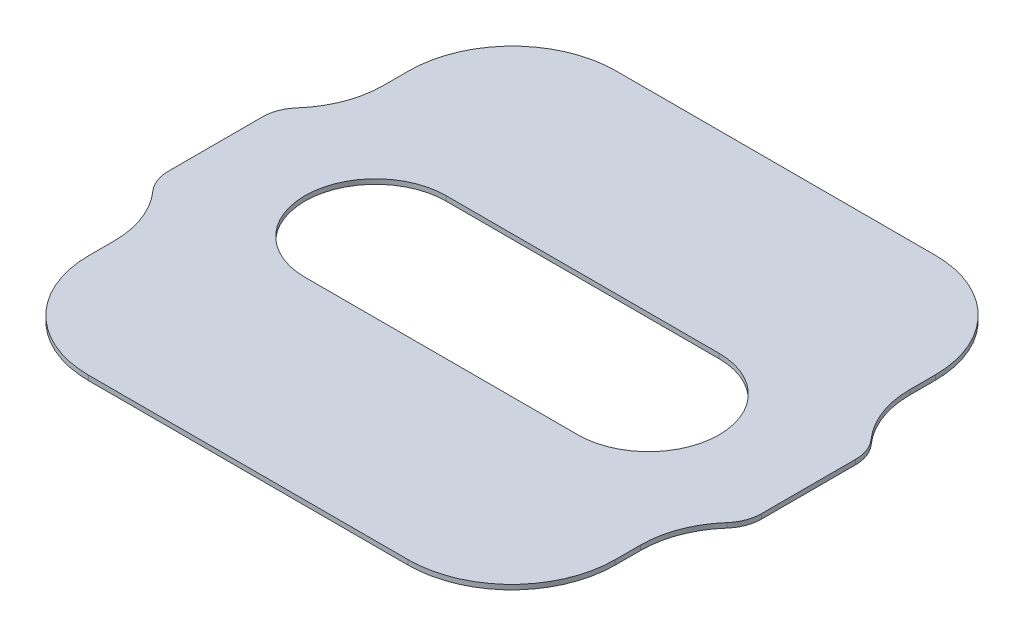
ISO-10303-21;
HEADER;
FILE_DESCRIPTION(('STEP AP214'),'2;1');
FILE_NAME('part.step','',(''),(''),'','','');
FILE_SCHEMA(('AUTOMOTIVE_DESIGN { 1 0 10303 214 1 1 1 1 }'));
ENDSEC;
DATA;
#1=APPLICATION_CONTEXT('core data for automotive mechanical design processes');
#2=APPLICATION_PROTOCOL_DEFINITION('international standard','automotive_design',2000,#1);
#3=PRODUCT_CONTEXT('',#1,'mechanical');
#4=PRODUCT('Part','Part','',(#3));
#5=PRODUCT_RELATED_PRODUCT_CATEGORY('part','',(#4));
#6=PRODUCT_DEFINITION_FORMATION('','',#4);
#7=PRODUCT_DEFINITION_CONTEXT('part definition',#1,'design');
#8=PRODUCT_DEFINITION('design','',#6,#7);
#9=PRODUCT_DEFINITION_SHAPE('','',#8);
#10=(LENGTH_UNIT() NAMED_UNIT(*) SI_UNIT(.MILLI.,.METRE.));
#11=(NAMED_UNIT(*) PLANE_ANGLE_UNIT() SI_UNIT($,.RADIAN.));
#12=(NAMED_UNIT(*) SI_UNIT($,.STERADIAN.) SOLID_ANGLE_UNIT());
#13=UNCERTAINTY_MEASURE_WITH_UNIT(LENGTH_MEASURE(1.E-05),#10,'distance_accuracy_value','');
#14=(GEOMETRIC_REPRESENTATION_CONTEXT(3) GLOBAL_UNCERTAINTY_ASSIGNED_CONTEXT((#13)) GLOBAL_UNIT_ASSIGNED_CONTEXT((#10,
#11,#12)) REPRESENTATION_CONTEXT('',''));
#15=CARTESIAN_POINT('',(0.,0.,0.));
#16=DIRECTION('',(0.,0.,1.));
#17=DIRECTION('',(1.,0.,0.));
#18=AXIS2_PLACEMENT_3D('',#15,#16,#17);
#19=CARTESIAN_POINT('',(16.1952754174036,0.0508,5.33075165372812));
#20=DIRECTION('',(0.,-1.,0.));
#21=DIRECTION('',(0.,0.,-1.));
#22=AXIS2_PLACEMENT_3D('',#19,#20,#21);
#23=CYLINDRICAL_SURFACE('',#22,0.400000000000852);
#24=CARTESIAN_POINT('',(16.1952754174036,0.,5.33075165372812));
#25=DIRECTION('',(0.,1.,0.));
#26=DIRECTION('',(0.,0.,1.));
#27=AXIS2_PLACEMENT_3D('',#24,#25,#26);
#28=CIRCLE('',#27,0.400000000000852);
#29=CARTESIAN_POINT('',(15.8963417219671,0.,5.06497233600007));
#30=VERTEX_POINT('',#29);
#31=CARTESIAN_POINT('',(15.7952754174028,0.,5.33075165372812));
#32=VERTEX_POINT('',#31);
#33=EDGE_CURVE('E230',#30,#32,#28,.T.);
#34=ORIENTED_EDGE('',*,*,#33,.T.);
#35=DIRECTION('',(0.,-1.,0.));
#36=VECTOR('',#35,1.);
#37=CARTESIAN_POINT('',(15.7952754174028,0.0508,5.33075165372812));
#38=LINE('',#37,#36);
#39=CARTESIAN_POINT('',(15.7952754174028,0.0508,5.33075165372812));
#40=VERTEX_POINT('',#39);
#41=EDGE_CURVE('E11',#40,#32,#38,.T.);
#42=ORIENTED_EDGE('',*,*,#41,.F.);
#43=CARTESIAN_POINT('',(16.1952754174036,0.0508,5.33075165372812));
#44=DIRECTION('',(0.,1.,0.));
#45=DIRECTION('',(0.,0.,1.));
#46=AXIS2_PLACEMENT_3D('',#43,#44,#45);
#47=CIRCLE('',#46,0.400000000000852);
#48=CARTESIAN_POINT('',(15.8963417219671,0.0508,5.06497233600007));
#49=VERTEX_POINT('',#48);
#50=EDGE_CURVE('E234',#49,#40,#47,.T.);
#51=ORIENTED_EDGE('',*,*,#50,.F.);
#52=DIRECTION('',(0.,-1.,0.));
#53=VECTOR('',#52,1.);
#54=CARTESIAN_POINT('',(15.8963417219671,0.0508,5.06497233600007));
#55=LINE('',#54,#53);
#56=EDGE_CURVE('E276',#49,#30,#55,.T.);
#57=ORIENTED_EDGE('',*,*,#56,.T.);
#58=EDGE_LOOP('',(#34,#42,#51,#57));
#59=FACE_BOUND('',#58,.T.);
#60=ADVANCED_FACE('F37',(#59),#23,.T.);
#61=CARTESIAN_POINT('',(15.7952754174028,0.0508,5.33075165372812));
#62=DIRECTION('',(1.,0.,0.));
#63=DIRECTION('',(0.,0.,-1.));
#64=AXIS2_PLACEMENT_3D('',#61,#62,#63);
#65=PLANE('',#64);
#66=DIRECTION('',(0.,0.,1.));
#67=VECTOR('',#66,1.);
#68=CARTESIAN_POINT('',(15.7952754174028,0.,5.33075165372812));
#69=LINE('',#68,#67);
#70=CARTESIAN_POINT('',(15.7952754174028,0.,6.33075165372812));
#71=VERTEX_POINT('',#70);
#72=EDGE_CURVE('E279',#32,#71,#69,.T.);
#73=ORIENTED_EDGE('',*,*,#72,.T.);
#74=DIRECTION('',(0.,-1.,0.));
#75=VECTOR('',#74,1.);
#76=CARTESIAN_POINT('',(15.7952754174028,0.0508,6.33075165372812));
#77=LINE('',#76,#75);
#78=CARTESIAN_POINT('',(15.7952754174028,0.0508,6.33075165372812));
#79=VERTEX_POINT('',#78);
#80=EDGE_CURVE('E44',#79,#71,#77,.T.);
#81=ORIENTED_EDGE('',*,*,#80,.F.);
#82=DIRECTION('',(0.,0.,1.));
#83=VECTOR('',#82,1.);
#84=CARTESIAN_POINT('',(15.7952754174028,0.0508,5.33075165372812));
#85=LINE('',#84,#83);
#86=EDGE_CURVE('E237',#40,#79,#85,.T.);
#87=ORIENTED_EDGE('',*,*,#86,.F.);
#88=ORIENTED_EDGE('',*,*,#41,.T.);
#89=EDGE_LOOP('',(#73,#81,#87,#88));
#90=FACE_BOUND('',#89,.T.);
#91=ADVANCED_FACE('F394',(#90),#65,.F.);
#92=CARTESIAN_POINT('',(16.1952754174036,0.0508,6.33075165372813));
#93=DIRECTION('',(0.,-1.,0.));
#94=DIRECTION('',(0.,0.,-1.));
#95=AXIS2_PLACEMENT_3D('',#92,#93,#94);
#96=CYLINDRICAL_SURFACE('',#95,0.400000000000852);
#97=CARTESIAN_POINT('',(16.1952754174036,0.,6.33075165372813));
#98=DIRECTION('',(0.,1.,0.));
#99=DIRECTION('',(0.,0.,-1.));
#100=AXIS2_PLACEMENT_3D('',#97,#98,#99);
#101=CIRCLE('',#100,0.400000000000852);
#102=CARTESIAN_POINT('',(15.8963417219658,0.,6.59653097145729));
#103=VERTEX_POINT('',#102);
#104=EDGE_CURVE('E281',#71,#103,#101,.T.);
#105=ORIENTED_EDGE('',*,*,#104,.T.);
#106=DIRECTION('',(0.,-1.,0.));
#107=VECTOR('',#106,1.);
#108=CARTESIAN_POINT('',(15.8963417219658,0.0508,6.59653097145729));
#109=LINE('',#108,#107);
#110=CARTESIAN_POINT('',(15.8963417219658,0.0508,6.59653097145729));
#111=VERTEX_POINT('',#110);
#112=EDGE_CURVE('E366',#111,#103,#109,.T.);
#113=ORIENTED_EDGE('',*,*,#112,.F.);
#114=CARTESIAN_POINT('',(16.1952754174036,0.0508,6.33075165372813));
#115=DIRECTION('',(0.,1.,0.));
#116=DIRECTION('',(0.,0.,-1.));
#117=AXIS2_PLACEMENT_3D('',#114,#115,#116);
#118=CIRCLE('',#117,0.400000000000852);
#119=EDGE_CURVE('E240',#79,#111,#118,.T.);
#120=ORIENTED_EDGE('',*,*,#119,.F.);
#121=ORIENTED_EDGE('',*,*,#80,.T.);
#122=EDGE_LOOP('',(#105,#113,#120,#121));
#123=FACE_BOUND('',#122,.T.);
#124=ADVANCED_FACE('F373',(#123),#96,.T.);
#125=CARTESIAN_POINT('',(15.149007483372,0.0508,7.2609792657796));
#126=DIRECTION('',(0.,-1.,0.));
#127=DIRECTION('',(0.,0.,-1.));
#128=AXIS2_PLACEMENT_3D('',#125,#126,#127);
#129=CYLINDRICAL_SURFACE('',#128,1.00000000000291);
#130=CARTESIAN_POINT('',(15.149007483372,0.,7.2609792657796));
#131=DIRECTION('',(0.,-1.,0.));
#132=DIRECTION('',(0.,0.,1.));
#133=AXIS2_PLACEMENT_3D('',#130,#131,#132);
#134=CIRCLE('',#133,1.00000000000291);
#135=CARTESIAN_POINT('',(16.1490074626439,0.,7.26077564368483));
#136=VERTEX_POINT('',#135);
#137=EDGE_CURVE('E283',#103,#136,#134,.T.);
#138=ORIENTED_EDGE('',*,*,#137,.T.);
#139=DIRECTION('',(0.,-1.,0.));
#140=VECTOR('',#139,1.);
#141=CARTESIAN_POINT('',(16.1490074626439,0.0508,7.26077564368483));
#142=LINE('',#141,#140);
#143=CARTESIAN_POINT('',(16.1490074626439,0.0508,7.26077564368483));
#144=VERTEX_POINT('',#143);
#145=EDGE_CURVE('E363',#144,#136,#142,.T.);
#146=ORIENTED_EDGE('',*,*,#145,.F.);
#147=CARTESIAN_POINT('',(15.149007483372,0.0508,7.2609792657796));
#148=DIRECTION('',(0.,-1.,0.));
#149=DIRECTION('',(0.,0.,1.));
#150=AXIS2_PLACEMENT_3D('',#147,#148,#149);
#151=CIRCLE('',#150,1.00000000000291);
#152=EDGE_CURVE('E242',#111,#144,#151,.T.);
#153=ORIENTED_EDGE('',*,*,#152,.F.);
#154=ORIENTED_EDGE('',*,*,#112,.T.);
#155=EDGE_LOOP('',(#138,#146,#153,#154));
#156=FACE_BOUND('',#155,.T.);
#157=ADVANCED_FACE('F382',(#156),#129,.F.);
#158=CARTESIAN_POINT('',(16.1490624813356,0.0508,7.53097563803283));
#159=DIRECTION('',(0.999999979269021,0.,-0.00020362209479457));
#160=DIRECTION('',(-0.00020362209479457,0.,-0.999999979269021));
#161=AXIS2_PLACEMENT_3D('',#158,#159,#160);
#162=PLANE('',#161);
#163=DIRECTION('',(0.00020362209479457,0.,0.999999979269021));
#164=VECTOR('',#163,1.);
#165=CARTESIAN_POINT('',(16.1490624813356,0.,7.53097563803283));
#166=LINE('',#165,#164);
#167=CARTESIAN_POINT('',(16.1490624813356,0.,7.53097563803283));
#168=VERTEX_POINT('',#167);
#169=EDGE_CURVE('E285',#136,#168,#166,.T.);
#170=ORIENTED_EDGE('',*,*,#169,.T.);
#171=DIRECTION('',(0.,-1.,0.));
#172=VECTOR('',#171,1.);
#173=CARTESIAN_POINT('',(16.1490624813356,0.0508,7.53097563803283));
#174=LINE('',#173,#172);
#175=CARTESIAN_POINT('',(16.1490624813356,0.0508,7.53097563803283));
#176=VERTEX_POINT('',#175);
#177=EDGE_CURVE('E360',#176,#168,#174,.T.);
#178=ORIENTED_EDGE('',*,*,#177,.F.);
#179=DIRECTION('',(0.00020362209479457,0.,0.999999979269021));
#180=VECTOR('',#179,1.);
#181=CARTESIAN_POINT('',(16.1490624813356,0.0508,7.53097563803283));
#182=LINE('',#181,#180);
#183=EDGE_CURVE('E244',#144,#176,#182,.T.);
#184=ORIENTED_EDGE('',*,*,#183,.F.);
#185=ORIENTED_EDGE('',*,*,#145,.T.);
#186=EDGE_LOOP('',(#170,#178,#184,#185));
#187=FACE_BOUND('',#186,.T.);
#188=ADVANCED_FACE('F386',(#187),#162,.F.);
#189=CARTESIAN_POINT('',(17.2490624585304,0.0508,7.53075165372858));
#190=DIRECTION('',(0.,-1.,0.));
#191=DIRECTION('',(0.,0.,-1.));
#192=AXIS2_PLACEMENT_3D('',#189,#190,#191);
#193=CYLINDRICAL_SURFACE('',#192,1.10000000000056);
#194=CARTESIAN_POINT('',(17.2490624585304,0.,7.53075165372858));
#195=DIRECTION('',(0.,1.,0.));
#196=DIRECTION('',(0.,0.,-1.));
#197=AXIS2_PLACEMENT_3D('',#194,#195,#196);
#198=CIRCLE('',#197,1.10000000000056);
#199=CARTESIAN_POINT('',(17.2490624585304,0.,8.63075165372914));
#200=VERTEX_POINT('',#199);
#201=EDGE_CURVE('E287',#168,#200,#198,.T.);
#202=ORIENTED_EDGE('',*,*,#201,.T.);
#203=DIRECTION('',(0.,-1.,0.));
#204=VECTOR('',#203,1.);
#205=CARTESIAN_POINT('',(17.2490624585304,0.0508,8.63075165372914));
#206=LINE('',#205,#204);
#207=CARTESIAN_POINT('',(17.2490624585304,0.0508,8.63075165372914));
#208=VERTEX_POINT('',#207);
#209=EDGE_CURVE('E357',#208,#200,#206,.T.);
#210=ORIENTED_EDGE('',*,*,#209,.F.);
#211=CARTESIAN_POINT('',(17.2490624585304,0.0508,7.53075165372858));
#212=DIRECTION('',(0.,1.,0.));
#213=DIRECTION('',(0.,0.,-1.));
#214=AXIS2_PLACEMENT_3D('',#211,#212,#213);
#215=CIRCLE('',#214,1.10000000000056);
#216=EDGE_CURVE('E246',#176,#208,#215,.T.);
#217=ORIENTED_EDGE('',*,*,#216,.F.);
#218=ORIENTED_EDGE('',*,*,#177,.T.);
#219=EDGE_LOOP('',(#202,#210,#217,#218));
#220=FACE_BOUND('',#219,.T.);
#221=ADVANCED_FACE('F467',(#220),#193,.T.);
#222=CARTESIAN_POINT('',(20.6414883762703,0.0508,8.63075165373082));
#223=DIRECTION('',(0.,0.,-1.));
#224=DIRECTION('',(-1.,0.,0.));
#225=AXIS2_PLACEMENT_3D('',#222,#223,#224);
#226=PLANE('',#225);
#227=DIRECTION('',(1.,0.,0.));
#228=VECTOR('',#227,1.);
#229=CARTESIAN_POINT('',(20.6414883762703,0.,8.63075165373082));
#230=LINE('',#229,#228);
#231=CARTESIAN_POINT('',(20.6414883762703,0.,8.63075165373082));
#232=VERTEX_POINT('',#231);
#233=EDGE_CURVE('E289',#200,#232,#230,.T.);
#234=ORIENTED_EDGE('',*,*,#233,.T.);
#235=DIRECTION('',(0.,-1.,0.));
#236=VECTOR('',#235,1.);
#237=CARTESIAN_POINT('',(20.6414883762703,0.0508,8.63075165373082));
#238=LINE('',#237,#236);
#239=CARTESIAN_POINT('',(20.6414883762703,0.0508,8.63075165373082));
#240=VERTEX_POINT('',#239);
#241=EDGE_CURVE('E354',#240,#232,#238,.T.);
#242=ORIENTED_EDGE('',*,*,#241,.F.);
#243=DIRECTION('',(1.,0.,0.));
#244=VECTOR('',#243,1.);
#245=CARTESIAN_POINT('',(20.6414883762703,0.0508,8.63075165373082));
#246=LINE('',#245,#244);
#247=EDGE_CURVE('E248',#208,#240,#246,.T.);
#248=ORIENTED_EDGE('',*,*,#247,.F.);
#249=ORIENTED_EDGE('',*,*,#209,.T.);
#250=EDGE_LOOP('',(#234,#242,#248,#249));
#251=FACE_BOUND('',#250,.T.);
#252=ADVANCED_FACE('F465',(#251),#226,.F.);
#253=CARTESIAN_POINT('',(20.6414883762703,0.0508,7.53075165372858));
#254=DIRECTION('',(0.,-1.,0.));
#255=DIRECTION('',(0.,0.,-1.));
#256=AXIS2_PLACEMENT_3D('',#253,#254,#255);
#257=CYLINDRICAL_SURFACE('',#256,1.10000000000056);
#258=CARTESIAN_POINT('',(20.6414883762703,0.,7.53075165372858));
#259=DIRECTION('',(0.,1.,0.));
#260=DIRECTION('',(0.,0.,1.));
#261=AXIS2_PLACEMENT_3D('',#258,#259,#260);
#262=CIRCLE('',#261,1.10000000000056);
#263=CARTESIAN_POINT('',(21.7414883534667,0.,7.53097563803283));
#264=VERTEX_POINT('',#263);
#265=EDGE_CURVE('E291',#232,#264,#262,.T.);
#266=ORIENTED_EDGE('',*,*,#265,.T.);
#267=DIRECTION('',(0.,-1.,0.));
#268=VECTOR('',#267,1.);
#269=CARTESIAN_POINT('',(21.7414883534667,0.0508,7.53097563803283));
#270=LINE('',#269,#268);
#271=CARTESIAN_POINT('',(21.7414883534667,0.0508,7.53097563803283));
#272=VERTEX_POINT('',#271);
#273=EDGE_CURVE('E351',#272,#264,#270,.T.);
#274=ORIENTED_EDGE('',*,*,#273,.F.);
#275=CARTESIAN_POINT('',(20.6414883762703,0.0508,7.53075165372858));
#276=DIRECTION('',(0.,1.,0.));
#277=DIRECTION('',(0.,0.,1.));
#278=AXIS2_PLACEMENT_3D('',#275,#276,#277);
#279=CIRCLE('',#278,1.10000000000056);
#280=EDGE_CURVE('E250',#240,#272,#279,.T.);
#281=ORIENTED_EDGE('',*,*,#280,.F.);
#282=ORIENTED_EDGE('',*,*,#241,.T.);
#283=EDGE_LOOP('',(#266,#274,#281,#282));
#284=FACE_BOUND('',#283,.T.);
#285=ADVANCED_FACE('F460',(#284),#257,.T.);
#286=CARTESIAN_POINT('',(21.7414883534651,0.0508,7.53097563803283));
#287=DIRECTION('',(-0.999999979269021,0.,-0.00020362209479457));
#288=DIRECTION('',(-0.00020362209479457,0.,0.999999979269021));
#289=AXIS2_PLACEMENT_3D('',#286,#287,#288);
#290=PLANE('',#289);
#291=DIRECTION('',(0.00020362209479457,0.,-0.999999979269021));
#292=VECTOR('',#291,1.);
#293=CARTESIAN_POINT('',(21.7414883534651,0.,7.53097563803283));
#294=LINE('',#293,#292);
#295=CARTESIAN_POINT('',(21.7415433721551,0.,7.26077564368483));
#296=VERTEX_POINT('',#295);
#297=EDGE_CURVE('E293',#264,#296,#294,.T.);
#298=ORIENTED_EDGE('',*,*,#297,.T.);
#299=DIRECTION('',(0.,-1.,0.));
#300=VECTOR('',#299,1.);
#301=CARTESIAN_POINT('',(21.7415433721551,0.0508,7.26077564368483));
#302=LINE('',#301,#300);
#303=CARTESIAN_POINT('',(21.7415433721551,0.0508,7.26077564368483));
#304=VERTEX_POINT('',#303);
#305=EDGE_CURVE('E348',#304,#296,#302,.T.);
#306=ORIENTED_EDGE('',*,*,#305,.F.);
#307=DIRECTION('',(0.00020362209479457,0.,-0.999999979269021));
#308=VECTOR('',#307,1.);
#309=CARTESIAN_POINT('',(21.7414883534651,0.0508,7.53097563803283));
#310=LINE('',#309,#308);
#311=EDGE_CURVE('E252',#272,#304,#310,.T.);
#312=ORIENTED_EDGE('',*,*,#311,.F.);
#313=ORIENTED_EDGE('',*,*,#273,.T.);
#314=EDGE_LOOP('',(#298,#306,#312,#313));
#315=FACE_BOUND('',#314,.T.);
#316=ADVANCED_FACE('F455',(#315),#290,.F.);
#317=CARTESIAN_POINT('',(22.7415433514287,0.0508,7.2609792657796));
#318=DIRECTION('',(0.,-1.,0.));
#319=DIRECTION('',(0.,0.,-1.));
#320=AXIS2_PLACEMENT_3D('',#317,#318,#319);
#321=CYLINDRICAL_SURFACE('',#320,1.00000000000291);
#322=CARTESIAN_POINT('',(22.7415433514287,0.,7.2609792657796));
#323=DIRECTION('',(0.,-1.,0.));
#324=DIRECTION('',(0.,0.,-1.));
#325=AXIS2_PLACEMENT_3D('',#322,#323,#324);
#326=CIRCLE('',#325,1.00000000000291);
#327=CARTESIAN_POINT('',(21.9942091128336,0.,6.59653097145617));
#328=VERTEX_POINT('',#327);
#329=EDGE_CURVE('E295',#296,#328,#326,.T.);
#330=ORIENTED_EDGE('',*,*,#329,.T.);
#331=DIRECTION('',(0.,-1.,0.));
#332=VECTOR('',#331,1.);
#333=CARTESIAN_POINT('',(21.9942091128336,0.0508,6.59653097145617));
#334=LINE('',#333,#332);
#335=CARTESIAN_POINT('',(21.9942091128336,0.0508,6.59653097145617));
#336=VERTEX_POINT('',#335);
#337=EDGE_CURVE('E345',#336,#328,#334,.T.);
#338=ORIENTED_EDGE('',*,*,#337,.F.);
#339=CARTESIAN_POINT('',(22.7415433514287,0.0508,7.2609792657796));
#340=DIRECTION('',(0.,-1.,0.));
#341=DIRECTION('',(0.,0.,-1.));
#342=AXIS2_PLACEMENT_3D('',#339,#340,#341);
#343=CIRCLE('',#342,1.00000000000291);
#344=EDGE_CURVE('E254',#304,#336,#343,.T.);
#345=ORIENTED_EDGE('',*,*,#344,.F.);
#346=ORIENTED_EDGE('',*,*,#305,.T.);
#347=EDGE_LOOP('',(#330,#338,#345,#346));
#348=FACE_BOUND('',#347,.T.);
#349=ADVANCED_FACE('F451',(#348),#321,.F.);
#350=CARTESIAN_POINT('',(21.695275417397,0.0508,6.33075165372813));
#351=DIRECTION('',(0.,-1.,0.));
#352=DIRECTION('',(0.,0.,-1.));
#353=AXIS2_PLACEMENT_3D('',#350,#351,#352);
#354=CYLINDRICAL_SURFACE('',#353,0.400000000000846);
#355=CARTESIAN_POINT('',(21.695275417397,0.,6.33075165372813));
#356=DIRECTION('',(0.,1.,0.));
#357=DIRECTION('',(0.,0.,1.));
#358=AXIS2_PLACEMENT_3D('',#355,#356,#357);
#359=CIRCLE('',#358,0.400000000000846);
#360=CARTESIAN_POINT('',(22.0952754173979,0.,6.33075165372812));
#361=VERTEX_POINT('',#360);
#362=EDGE_CURVE('E297',#328,#361,#359,.T.);
#363=ORIENTED_EDGE('',*,*,#362,.T.);
#364=DIRECTION('',(0.,-1.,0.));
#365=VECTOR('',#364,1.);
#366=CARTESIAN_POINT('',(22.0952754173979,0.0508,6.33075165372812));
#367=LINE('',#366,#365);
#368=CARTESIAN_POINT('',(22.0952754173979,0.0508,6.33075165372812));
#369=VERTEX_POINT('',#368);
#370=EDGE_CURVE('E342',#369,#361,#367,.T.);
#371=ORIENTED_EDGE('',*,*,#370,.F.);
#372=CARTESIAN_POINT('',(21.695275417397,0.0508,6.33075165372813));
#373=DIRECTION('',(0.,1.,0.));
#374=DIRECTION('',(0.,0.,1.));
#375=AXIS2_PLACEMENT_3D('',#372,#373,#374);
#376=CIRCLE('',#375,0.400000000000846);
#377=EDGE_CURVE('E256',#336,#369,#376,.T.);
#378=ORIENTED_EDGE('',*,*,#377,.F.);
#379=ORIENTED_EDGE('',*,*,#337,.T.);
#380=EDGE_LOOP('',(#363,#371,#378,#379));
#381=FACE_BOUND('',#380,.T.);
#382=ADVANCED_FACE('F446',(#381),#354,.T.);
#383=CARTESIAN_POINT('',(22.0952754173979,0.0508,5.33075165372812));
#384=DIRECTION('',(-1.,0.,0.));
#385=DIRECTION('',(0.,0.,1.));
#386=AXIS2_PLACEMENT_3D('',#383,#384,#385);
#387=PLANE('',#386);
#388=DIRECTION('',(0.,0.,-1.));
#389=VECTOR('',#388,1.);
#390=CARTESIAN_POINT('',(22.0952754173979,0.,5.33075165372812));
#391=LINE('',#390,#389);
#392=CARTESIAN_POINT('',(22.0952754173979,0.,5.33075165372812));
#393=VERTEX_POINT('',#392);
#394=EDGE_CURVE('E299',#361,#393,#391,.T.);
#395=ORIENTED_EDGE('',*,*,#394,.T.);
#396=DIRECTION('',(0.,-1.,0.));
#397=VECTOR('',#396,1.);
#398=CARTESIAN_POINT('',(22.0952754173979,0.0508,5.33075165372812));
#399=LINE('',#398,#397);
#400=CARTESIAN_POINT('',(22.0952754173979,0.0508,5.33075165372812));
#401=VERTEX_POINT('',#400);
#402=EDGE_CURVE('E339',#401,#393,#399,.T.);
#403=ORIENTED_EDGE('',*,*,#402,.F.);
#404=DIRECTION('',(0.,0.,-1.));
#405=VECTOR('',#404,1.);
#406=CARTESIAN_POINT('',(22.0952754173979,0.0508,5.33075165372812));
#407=LINE('',#406,#405);
#408=EDGE_CURVE('E258',#369,#401,#407,.T.);
#409=ORIENTED_EDGE('',*,*,#408,.F.);
#410=ORIENTED_EDGE('',*,*,#370,.T.);
#411=EDGE_LOOP('',(#395,#403,#409,#410));
#412=FACE_BOUND('',#411,.T.);
#413=ADVANCED_FACE('F440',(#412),#387,.F.);
#414=CARTESIAN_POINT('',(21.695275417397,0.0508,5.33075165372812));
#415=DIRECTION('',(0.,-1.,0.));
#416=DIRECTION('',(0.,0.,-1.));
#417=AXIS2_PLACEMENT_3D('',#414,#415,#416);
#418=CYLINDRICAL_SURFACE('',#417,0.400000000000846);
#419=CARTESIAN_POINT('',(21.695275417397,0.,5.33075165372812));
#420=DIRECTION('',(0.,1.,0.));
#421=DIRECTION('',(0.,0.,-1.));
#422=AXIS2_PLACEMENT_3D('',#419,#420,#421);
#423=CIRCLE('',#422,0.400000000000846);
#424=CARTESIAN_POINT('',(21.9942091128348,0.,5.06497233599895));
#425=VERTEX_POINT('',#424);
#426=EDGE_CURVE('E301',#393,#425,#423,.T.);
#427=ORIENTED_EDGE('',*,*,#426,.T.);
#428=DIRECTION('',(0.,-1.,0.));
#429=VECTOR('',#428,1.);
#430=CARTESIAN_POINT('',(21.9942091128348,0.0508,5.06497233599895));
#431=LINE('',#430,#429);
#432=CARTESIAN_POINT('',(21.9942091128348,0.0508,5.06497233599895));
#433=VERTEX_POINT('',#432);
#434=EDGE_CURVE('E336',#433,#425,#431,.T.);
#435=ORIENTED_EDGE('',*,*,#434,.F.);
#436=CARTESIAN_POINT('',(21.695275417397,0.0508,5.33075165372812));
#437=DIRECTION('',(0.,1.,0.));
#438=DIRECTION('',(0.,0.,-1.));
#439=AXIS2_PLACEMENT_3D('',#436,#437,#438);
#440=CIRCLE('',#439,0.400000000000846);
#441=EDGE_CURVE('E260',#401,#433,#440,.T.);
#442=ORIENTED_EDGE('',*,*,#441,.F.);
#443=ORIENTED_EDGE('',*,*,#402,.T.);
#444=EDGE_LOOP('',(#427,#435,#442,#443));
#445=FACE_BOUND('',#444,.T.);
#446=ADVANCED_FACE('F436',(#445),#418,.T.);
#447=CARTESIAN_POINT('',(22.7415433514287,0.0508,4.40052404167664));
#448=DIRECTION('',(0.,-1.,0.));
#449=DIRECTION('',(0.,0.,-1.));
#450=AXIS2_PLACEMENT_3D('',#447,#448,#449);
#451=CYLINDRICAL_SURFACE('',#450,1.00000000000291);
#452=CARTESIAN_POINT('',(22.7415433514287,0.,4.40052404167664));
#453=DIRECTION('',(0.,-1.,0.));
#454=DIRECTION('',(0.,0.,1.));
#455=AXIS2_PLACEMENT_3D('',#452,#453,#454);
#456=CIRCLE('',#455,1.00000000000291);
#457=CARTESIAN_POINT('',(21.7415433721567,0.,4.40072766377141));
#458=VERTEX_POINT('',#457);
#459=EDGE_CURVE('E303',#425,#458,#456,.T.);
#460=ORIENTED_EDGE('',*,*,#459,.T.);
#461=DIRECTION('',(0.,-1.,0.));
#462=VECTOR('',#461,1.);
#463=CARTESIAN_POINT('',(21.7415433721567,0.0508,4.40072766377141));
#464=LINE('',#463,#462);
#465=CARTESIAN_POINT('',(21.7415433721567,0.0508,4.40072766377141));
#466=VERTEX_POINT('',#465);
#467=EDGE_CURVE('E333',#466,#458,#464,.T.);
#468=ORIENTED_EDGE('',*,*,#467,.F.);
#469=CARTESIAN_POINT('',(22.7415433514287,0.0508,4.40052404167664));
#470=DIRECTION('',(0.,-1.,0.));
#471=DIRECTION('',(0.,0.,1.));
#472=AXIS2_PLACEMENT_3D('',#469,#470,#471);
#473=CIRCLE('',#472,1.00000000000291);
#474=EDGE_CURVE('E262',#433,#466,#473,.T.);
#475=ORIENTED_EDGE('',*,*,#474,.F.);
#476=ORIENTED_EDGE('',*,*,#434,.T.);
#477=EDGE_LOOP('',(#460,#468,#475,#476));
#478=FACE_BOUND('',#477,.T.);
#479=ADVANCED_FACE('F431',(#478),#451,.F.);
#480=CARTESIAN_POINT('',(21.7414883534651,0.0508,4.13052766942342));
#481=DIRECTION('',(-0.999999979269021,0.,0.00020362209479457));
#482=DIRECTION('',(0.00020362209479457,0.,0.999999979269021));
#483=AXIS2_PLACEMENT_3D('',#480,#481,#482);
#484=PLANE('',#483);
#485=DIRECTION('',(-0.00020362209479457,0.,-0.999999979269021));
#486=VECTOR('',#485,1.);
#487=CARTESIAN_POINT('',(21.7414883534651,0.,4.13052766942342));
#488=LINE('',#487,#486);
#489=CARTESIAN_POINT('',(21.7414883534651,0.,4.13052766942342));
#490=VERTEX_POINT('',#489);
#491=EDGE_CURVE('E305',#458,#490,#488,.T.);
#492=ORIENTED_EDGE('',*,*,#491,.T.);
#493=DIRECTION('',(0.,-1.,0.));
#494=VECTOR('',#493,1.);
#495=CARTESIAN_POINT('',(21.7414883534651,0.0508,4.13052766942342));
#496=LINE('',#495,#494);
#497=CARTESIAN_POINT('',(21.7414883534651,0.0508,4.13052766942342));
#498=VERTEX_POINT('',#497);
#499=EDGE_CURVE('E330',#498,#490,#496,.T.);
#500=ORIENTED_EDGE('',*,*,#499,.F.);
#501=DIRECTION('',(-0.00020362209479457,0.,-0.999999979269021));
#502=VECTOR('',#501,1.);
#503=CARTESIAN_POINT('',(21.7414883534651,0.0508,4.13052766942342));
#504=LINE('',#503,#502);
#505=EDGE_CURVE('E264',#466,#498,#504,.T.);
#506=ORIENTED_EDGE('',*,*,#505,.F.);
#507=ORIENTED_EDGE('',*,*,#467,.T.);
#508=EDGE_LOOP('',(#492,#500,#506,#507));
#509=FACE_BOUND('',#508,.T.);
#510=ADVANCED_FACE('F425',(#509),#484,.F.);
#511=CARTESIAN_POINT('',(20.6414883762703,0.0508,4.13075165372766));
#512=DIRECTION('',(0.,-1.,0.));
#513=DIRECTION('',(0.,0.,-1.));
#514=AXIS2_PLACEMENT_3D('',#511,#512,#513);
#515=CYLINDRICAL_SURFACE('',#514,1.10000000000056);
#516=CARTESIAN_POINT('',(20.6414883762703,0.,4.13075165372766));
#517=DIRECTION('',(0.,1.,0.));
#518=DIRECTION('',(0.,0.,-1.));
#519=AXIS2_PLACEMENT_3D('',#516,#517,#518);
#520=CIRCLE('',#519,1.10000000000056);
#521=CARTESIAN_POINT('',(20.6414883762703,0.,3.0307516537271));
#522=VERTEX_POINT('',#521);
#523=EDGE_CURVE('E307',#490,#522,#520,.T.);
#524=ORIENTED_EDGE('',*,*,#523,.T.);
#525=DIRECTION('',(0.,-1.,0.));
#526=VECTOR('',#525,1.);
#527=CARTESIAN_POINT('',(20.6414883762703,0.0508,3.0307516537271));
#528=LINE('',#527,#526);
#529=CARTESIAN_POINT('',(20.6414883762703,0.0508,3.0307516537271));
#530=VERTEX_POINT('',#529);
#531=EDGE_CURVE('E327',#530,#522,#528,.T.);
#532=ORIENTED_EDGE('',*,*,#531,.F.);
#533=CARTESIAN_POINT('',(20.6414883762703,0.0508,4.13075165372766));
#534=DIRECTION('',(0.,1.,0.));
#535=DIRECTION('',(0.,0.,-1.));
#536=AXIS2_PLACEMENT_3D('',#533,#534,#535);
#537=CIRCLE('',#536,1.10000000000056);
#538=EDGE_CURVE('E266',#498,#530,#537,.T.);
#539=ORIENTED_EDGE('',*,*,#538,.F.);
#540=ORIENTED_EDGE('',*,*,#499,.T.);
#541=EDGE_LOOP('',(#524,#532,#539,#540));
#542=FACE_BOUND('',#541,.T.);
#543=ADVANCED_FACE('F421',(#542),#515,.T.);
#544=CARTESIAN_POINT('',(20.6414883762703,0.0508,3.03075165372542));
#545=DIRECTION('',(0.,0.,1.));
#546=DIRECTION('',(1.,0.,0.));
#547=AXIS2_PLACEMENT_3D('',#544,#545,#546);
#548=PLANE('',#547);
#549=DIRECTION('',(-1.,0.,0.));
#550=VECTOR('',#549,1.);
#551=CARTESIAN_POINT('',(20.6414883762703,0.,3.03075165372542));
#552=LINE('',#551,#550);
#553=CARTESIAN_POINT('',(17.2490624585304,0.,3.03075165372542));
#554=VERTEX_POINT('',#553);
#555=EDGE_CURVE('E309',#522,#554,#552,.T.);
#556=ORIENTED_EDGE('',*,*,#555,.T.);
#557=DIRECTION('',(0.,-1.,0.));
#558=VECTOR('',#557,1.);
#559=CARTESIAN_POINT('',(17.2490624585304,0.0508,3.03075165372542));
#560=LINE('',#559,#558);
#561=CARTESIAN_POINT('',(17.2490624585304,0.0508,3.03075165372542));
#562=VERTEX_POINT('',#561);
#563=EDGE_CURVE('E324',#562,#554,#560,.T.);
#564=ORIENTED_EDGE('',*,*,#563,.F.);
#565=DIRECTION('',(-1.,0.,0.));
#566=VECTOR('',#565,1.);
#567=CARTESIAN_POINT('',(20.6414883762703,0.0508,3.03075165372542));
#568=LINE('',#567,#566);
#569=EDGE_CURVE('E268',#530,#562,#568,.T.);
#570=ORIENTED_EDGE('',*,*,#569,.F.);
#571=ORIENTED_EDGE('',*,*,#531,.T.);
#572=EDGE_LOOP('',(#556,#564,#570,#571));
#573=FACE_BOUND('',#572,.T.);
#574=ADVANCED_FACE('F416',(#573),#548,.F.);
#575=CARTESIAN_POINT('',(17.2490624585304,0.0508,4.13075165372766));
#576=DIRECTION('',(0.,-1.,0.));
#577=DIRECTION('',(0.,0.,-1.));
#578=AXIS2_PLACEMENT_3D('',#575,#576,#577);
#579=CYLINDRICAL_SURFACE('',#578,1.10000000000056);
#580=CARTESIAN_POINT('',(17.2490624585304,0.,4.13075165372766));
#581=DIRECTION('',(0.,1.,0.));
#582=DIRECTION('',(0.,0.,1.));
#583=AXIS2_PLACEMENT_3D('',#580,#581,#582);
#584=CIRCLE('',#583,1.10000000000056);
#585=CARTESIAN_POINT('',(16.1490624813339,0.,4.13052766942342));
#586=VERTEX_POINT('',#585);
#587=EDGE_CURVE('E311',#554,#586,#584,.T.);
#588=ORIENTED_EDGE('',*,*,#587,.T.);
#589=DIRECTION('',(0.,-1.,0.));
#590=VECTOR('',#589,1.);
#591=CARTESIAN_POINT('',(16.1490624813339,0.0508,4.13052766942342));
#592=LINE('',#591,#590);
#593=CARTESIAN_POINT('',(16.1490624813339,0.0508,4.13052766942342));
#594=VERTEX_POINT('',#593);
#595=EDGE_CURVE('E321',#594,#586,#592,.T.);
#596=ORIENTED_EDGE('',*,*,#595,.F.);
#597=CARTESIAN_POINT('',(17.2490624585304,0.0508,4.13075165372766));
#598=DIRECTION('',(0.,1.,0.));
#599=DIRECTION('',(0.,0.,1.));
#600=AXIS2_PLACEMENT_3D('',#597,#598,#599);
#601=CIRCLE('',#600,1.10000000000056);
#602=EDGE_CURVE('E270',#562,#594,#601,.T.);
#603=ORIENTED_EDGE('',*,*,#602,.F.);
#604=ORIENTED_EDGE('',*,*,#563,.T.);
#605=EDGE_LOOP('',(#588,#596,#603,#604));
#606=FACE_BOUND('',#605,.T.);
#607=ADVANCED_FACE('F410',(#606),#579,.T.);
#608=CARTESIAN_POINT('',(16.1490624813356,0.0508,4.13052766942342));
#609=DIRECTION('',(0.999999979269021,0.,0.00020362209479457));
#610=DIRECTION('',(0.00020362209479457,0.,-0.999999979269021));
#611=AXIS2_PLACEMENT_3D('',#608,#609,#610);
#612=PLANE('',#611);
#613=DIRECTION('',(-0.00020362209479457,0.,0.999999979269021));
#614=VECTOR('',#613,1.);
#615=CARTESIAN_POINT('',(16.1490624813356,0.,4.13052766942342));
#616=LINE('',#615,#614);
#617=CARTESIAN_POINT('',(16.1490074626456,0.,4.40072766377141));
#618=VERTEX_POINT('',#617);
#619=EDGE_CURVE('E313',#586,#618,#616,.T.);
#620=ORIENTED_EDGE('',*,*,#619,.T.);
#621=DIRECTION('',(0.,-1.,0.));
#622=VECTOR('',#621,1.);
#623=CARTESIAN_POINT('',(16.1490074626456,0.0508,4.40072766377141));
#624=LINE('',#623,#622);
#625=CARTESIAN_POINT('',(16.1490074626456,0.0508,4.40072766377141));
#626=VERTEX_POINT('',#625);
#627=EDGE_CURVE('E318',#626,#618,#624,.T.);
#628=ORIENTED_EDGE('',*,*,#627,.F.);
#629=DIRECTION('',(-0.00020362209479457,0.,0.999999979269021));
#630=VECTOR('',#629,1.);
#631=CARTESIAN_POINT('',(16.1490624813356,0.0508,4.13052766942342));
#632=LINE('',#631,#630);
#633=EDGE_CURVE('E272',#594,#626,#632,.T.);
#634=ORIENTED_EDGE('',*,*,#633,.F.);
#635=ORIENTED_EDGE('',*,*,#595,.T.);
#636=EDGE_LOOP('',(#620,#628,#634,#635));
#637=FACE_BOUND('',#636,.T.);
#638=ADVANCED_FACE('F406',(#637),#612,.F.);
#639=CARTESIAN_POINT('',(15.149007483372,0.0508,4.40052404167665));
#640=DIRECTION('',(0.,-1.,0.));
#641=DIRECTION('',(0.,0.,-1.));
#642=AXIS2_PLACEMENT_3D('',#639,#640,#641);
#643=CYLINDRICAL_SURFACE('',#642,1.00000000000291);
#644=CARTESIAN_POINT('',(15.149007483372,0.,4.40052404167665));
#645=DIRECTION('',(0.,-1.,0.));
#646=DIRECTION('',(0.,0.,-1.));
#647=AXIS2_PLACEMENT_3D('',#644,#645,#646);
#648=CIRCLE('',#647,1.00000000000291);
#649=EDGE_CURVE('E238',#618,#30,#648,.T.);
#650=ORIENTED_EDGE('',*,*,#649,.T.);
#651=ORIENTED_EDGE('',*,*,#56,.F.);
#652=CARTESIAN_POINT('',(15.149007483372,0.0508,4.40052404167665));
#653=DIRECTION('',(0.,-1.,0.));
#654=DIRECTION('',(0.,0.,-1.));
#655=AXIS2_PLACEMENT_3D('',#652,#653,#654);
#656=CIRCLE('',#655,1.00000000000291);
#657=EDGE_CURVE('E274',#626,#49,#656,.T.);
#658=ORIENTED_EDGE('',*,*,#657,.F.);
#659=ORIENTED_EDGE('',*,*,#627,.T.);
#660=EDGE_LOOP('',(#650,#651,#658,#659));
#661=FACE_BOUND('',#660,.T.);
#662=ADVANCED_FACE('F401',(#661),#643,.F.);
#663=CARTESIAN_POINT('',(16.1952754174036,0.0508,5.33075165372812));
#664=DIRECTION('',(0.,1.,0.));
#665=DIRECTION('',(0.,0.,1.));
#666=AXIS2_PLACEMENT_3D('',#663,#664,#665);
#667=PLANE('',#666);
#668=CARTESIAN_POINT('',(17.4952754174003,0.0508,5.83075165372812));
#669=DIRECTION('',(0.,1.,0.));
#670=DIRECTION('',(0.,0.,1.));
#671=AXIS2_PLACEMENT_3D('',#668,#669,#670);
#672=CIRCLE('',#671,0.750000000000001);
#673=CARTESIAN_POINT('',(17.4952754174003,0.0508,5.08075165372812));
#674=VERTEX_POINT('',#673);
#675=CARTESIAN_POINT('',(17.4952754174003,0.0508,6.58075165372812));
#676=VERTEX_POINT('',#675);
#677=EDGE_CURVE('E51',#674,#676,#672,.T.);
#678=ORIENTED_EDGE('',*,*,#677,.F.);
#679=DIRECTION('',(-1.,0.,0.));
#680=VECTOR('',#679,1.);
#681=CARTESIAN_POINT('',(17.4952754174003,0.0508,5.08075165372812));
#682=LINE('',#681,#680);
#683=CARTESIAN_POINT('',(20.3952754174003,0.0508,5.08075165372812));
#684=VERTEX_POINT('',#683);
#685=EDGE_CURVE('E215',#684,#674,#682,.T.);
#686=ORIENTED_EDGE('',*,*,#685,.F.);
#687=CARTESIAN_POINT('',(20.3952754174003,0.0508,5.83075165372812));
#688=DIRECTION('',(0.,1.,0.));
#689=DIRECTION('',(0.,0.,1.));
#690=AXIS2_PLACEMENT_3D('',#687,#688,#689);
#691=CIRCLE('',#690,0.750000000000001);
#692=CARTESIAN_POINT('',(20.3952754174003,0.0508,6.58075165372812));
#693=VERTEX_POINT('',#692);
#694=EDGE_CURVE('E218',#693,#684,#691,.T.);
#695=ORIENTED_EDGE('',*,*,#694,.F.);
#696=DIRECTION('',(1.,0.,0.));
#697=VECTOR('',#696,1.);
#698=CARTESIAN_POINT('',(17.4952754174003,0.0508,6.58075165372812));
#699=LINE('',#698,#697);
#700=EDGE_CURVE('E224',#676,#693,#699,.T.);
#701=ORIENTED_EDGE('',*,*,#700,.F.);
#702=EDGE_LOOP('',(#678,#686,#695,#701));
#703=FACE_BOUND('',#702,.T.);
#704=ORIENTED_EDGE('',*,*,#50,.T.);
#705=ORIENTED_EDGE('',*,*,#86,.T.);
#706=ORIENTED_EDGE('',*,*,#119,.T.);
#707=ORIENTED_EDGE('',*,*,#152,.T.);
#708=ORIENTED_EDGE('',*,*,#183,.T.);
#709=ORIENTED_EDGE('',*,*,#216,.T.);
#710=ORIENTED_EDGE('',*,*,#247,.T.);
#711=ORIENTED_EDGE('',*,*,#280,.T.);
#712=ORIENTED_EDGE('',*,*,#311,.T.);
#713=ORIENTED_EDGE('',*,*,#344,.T.);
#714=ORIENTED_EDGE('',*,*,#377,.T.);
#715=ORIENTED_EDGE('',*,*,#408,.T.);
#716=ORIENTED_EDGE('',*,*,#441,.T.);
#717=ORIENTED_EDGE('',*,*,#474,.T.);
#718=ORIENTED_EDGE('',*,*,#505,.T.);
#719=ORIENTED_EDGE('',*,*,#538,.T.);
#720=ORIENTED_EDGE('',*,*,#569,.T.);
#721=ORIENTED_EDGE('',*,*,#602,.T.);
#722=ORIENTED_EDGE('',*,*,#633,.T.);
#723=ORIENTED_EDGE('',*,*,#657,.T.);
#724=EDGE_LOOP('',(#704,#705,#706,#707,#708,#709,#710,#711,#712,#713,#714,#715,#716,#717,#718,
#719,#720,#721,#722,#723));
#725=FACE_BOUND('',#724,.T.);
#726=ADVANCED_FACE('F390',(#703,#725),#667,.T.);
#727=CARTESIAN_POINT('',(16.1952754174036,0.,5.33075165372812));
#728=DIRECTION('',(0.,1.,0.));
#729=DIRECTION('',(0.,0.,1.));
#730=AXIS2_PLACEMENT_3D('',#727,#728,#729);
#731=PLANE('',#730);
#732=DIRECTION('',(-1.,0.,0.));
#733=VECTOR('',#732,1.);
#734=CARTESIAN_POINT('',(17.4952754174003,0.,5.08075165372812));
#735=LINE('',#734,#733);
#736=CARTESIAN_POINT('',(20.3952754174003,0.,5.08075165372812));
#737=VERTEX_POINT('',#736);
#738=CARTESIAN_POINT('',(17.4952754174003,0.,5.08075165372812));
#739=VERTEX_POINT('',#738);
#740=EDGE_CURVE('E205',#737,#739,#735,.T.);
#741=ORIENTED_EDGE('',*,*,#740,.T.);
#742=CARTESIAN_POINT('',(17.4952754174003,0.,5.83075165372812));
#743=DIRECTION('',(0.,1.,0.));
#744=DIRECTION('',(0.,0.,1.));
#745=AXIS2_PLACEMENT_3D('',#742,#743,#744);
#746=CIRCLE('',#745,0.750000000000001);
#747=CARTESIAN_POINT('',(17.4952754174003,0.,6.58075165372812));
#748=VERTEX_POINT('',#747);
#749=EDGE_CURVE('E199',#739,#748,#746,.T.);
#750=ORIENTED_EDGE('',*,*,#749,.T.);
#751=DIRECTION('',(1.,0.,0.));
#752=VECTOR('',#751,1.);
#753=CARTESIAN_POINT('',(17.4952754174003,0.,6.58075165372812));
#754=LINE('',#753,#752);
#755=CARTESIAN_POINT('',(20.3952754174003,0.,6.58075165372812));
#756=VERTEX_POINT('',#755);
#757=EDGE_CURVE('E208',#748,#756,#754,.T.);
#758=ORIENTED_EDGE('',*,*,#757,.T.);
#759=CARTESIAN_POINT('',(20.3952754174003,0.,5.83075165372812));
#760=DIRECTION('',(0.,1.,0.));
#761=DIRECTION('',(0.,0.,1.));
#762=AXIS2_PLACEMENT_3D('',#759,#760,#761);
#763=CIRCLE('',#762,0.750000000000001);
#764=EDGE_CURVE('E59',#756,#737,#763,.T.);
#765=ORIENTED_EDGE('',*,*,#764,.T.);
#766=EDGE_LOOP('',(#741,#750,#758,#765));
#767=FACE_BOUND('',#766,.T.);
#768=ORIENTED_EDGE('',*,*,#33,.F.);
#769=ORIENTED_EDGE('',*,*,#649,.F.);
#770=ORIENTED_EDGE('',*,*,#619,.F.);
#771=ORIENTED_EDGE('',*,*,#587,.F.);
#772=ORIENTED_EDGE('',*,*,#555,.F.);
#773=ORIENTED_EDGE('',*,*,#523,.F.);
#774=ORIENTED_EDGE('',*,*,#491,.F.);
#775=ORIENTED_EDGE('',*,*,#459,.F.);
#776=ORIENTED_EDGE('',*,*,#426,.F.);
#777=ORIENTED_EDGE('',*,*,#394,.F.);
#778=ORIENTED_EDGE('',*,*,#362,.F.);
#779=ORIENTED_EDGE('',*,*,#329,.F.);
#780=ORIENTED_EDGE('',*,*,#297,.F.);
#781=ORIENTED_EDGE('',*,*,#265,.F.);
#782=ORIENTED_EDGE('',*,*,#233,.F.);
#783=ORIENTED_EDGE('',*,*,#201,.F.);
#784=ORIENTED_EDGE('',*,*,#169,.F.);
#785=ORIENTED_EDGE('',*,*,#137,.F.);
#786=ORIENTED_EDGE('',*,*,#104,.F.);
#787=ORIENTED_EDGE('',*,*,#72,.F.);
#788=EDGE_LOOP('',(#768,#769,#770,#771,#772,#773,#774,#775,#776,#777,#778,#779,#780,#781,#782,
#783,#784,#785,#786,#787));
#789=FACE_BOUND('',#788,.T.);
#790=ADVANCED_FACE('F212',(#767,#789),#731,.F.);
#791=CARTESIAN_POINT('',(17.4952754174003,0.,5.83075165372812));
#792=DIRECTION('',(0.,1.,0.));
#793=DIRECTION('',(0.,0.,1.));
#794=AXIS2_PLACEMENT_3D('',#791,#792,#793);
#795=CYLINDRICAL_SURFACE('',#794,0.750000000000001);
#796=ORIENTED_EDGE('',*,*,#677,.T.);
#797=DIRECTION('',(0.,1.,0.));
#798=VECTOR('',#797,1.);
#799=CARTESIAN_POINT('',(17.4952754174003,0.,6.58075165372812));
#800=LINE('',#799,#798);
#801=EDGE_CURVE('E195',#748,#676,#800,.T.);
#802=ORIENTED_EDGE('',*,*,#801,.F.);
#803=ORIENTED_EDGE('',*,*,#749,.F.);
#804=DIRECTION('',(0.,1.,0.));
#805=VECTOR('',#804,1.);
#806=CARTESIAN_POINT('',(17.4952754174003,0.,5.08075165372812));
#807=LINE('',#806,#805);
#808=EDGE_CURVE('E228',#739,#674,#807,.T.);
#809=ORIENTED_EDGE('',*,*,#808,.T.);
#810=EDGE_LOOP('',(#796,#802,#803,#809));
#811=FACE_BOUND('',#810,.T.);
#812=ADVANCED_FACE('F197',(#811),#795,.F.);
#813=CARTESIAN_POINT('',(17.4952754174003,0.,5.08075165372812));
#814=DIRECTION('',(0.,0.,-1.));
#815=DIRECTION('',(-1.,0.,0.));
#816=AXIS2_PLACEMENT_3D('',#813,#814,#815);
#817=PLANE('',#816);
#818=ORIENTED_EDGE('',*,*,#685,.T.);
#819=ORIENTED_EDGE('',*,*,#808,.F.);
#820=ORIENTED_EDGE('',*,*,#740,.F.);
#821=DIRECTION('',(0.,1.,0.));
#822=VECTOR('',#821,1.);
#823=CARTESIAN_POINT('',(20.3952754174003,0.,5.08075165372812));
#824=LINE('',#823,#822);
#825=EDGE_CURVE('E231',#737,#684,#824,.T.);
#826=ORIENTED_EDGE('',*,*,#825,.T.);
#827=EDGE_LOOP('',(#818,#819,#820,#826));
#828=FACE_BOUND('',#827,.T.);
#829=ADVANCED_FACE('F652',(#828),#817,.F.);
#830=CARTESIAN_POINT('',(20.3952754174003,0.,5.83075165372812));
#831=DIRECTION('',(0.,1.,0.));
#832=DIRECTION('',(0.,0.,1.));
#833=AXIS2_PLACEMENT_3D('',#830,#831,#832);
#834=CYLINDRICAL_SURFACE('',#833,0.750000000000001);
#835=ORIENTED_EDGE('',*,*,#694,.T.);
#836=ORIENTED_EDGE('',*,*,#825,.F.);
#837=ORIENTED_EDGE('',*,*,#764,.F.);
#838=DIRECTION('',(0.,1.,0.));
#839=VECTOR('',#838,1.);
#840=CARTESIAN_POINT('',(20.3952754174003,0.,6.58075165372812));
#841=LINE('',#840,#839);
#842=EDGE_CURVE('E204',#756,#693,#841,.T.);
#843=ORIENTED_EDGE('',*,*,#842,.T.);
#844=EDGE_LOOP('',(#835,#836,#837,#843));
#845=FACE_BOUND('',#844,.T.);
#846=ADVANCED_FACE('F662',(#845),#834,.F.);
#847=CARTESIAN_POINT('',(17.4952754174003,0.,6.58075165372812));
#848=DIRECTION('',(0.,0.,1.));
#849=DIRECTION('',(1.,0.,0.));
#850=AXIS2_PLACEMENT_3D('',#847,#848,#849);
#851=PLANE('',#850);
#852=ORIENTED_EDGE('',*,*,#700,.T.);
#853=ORIENTED_EDGE('',*,*,#842,.F.);
#854=ORIENTED_EDGE('',*,*,#757,.F.);
#855=ORIENTED_EDGE('',*,*,#801,.T.);
#856=EDGE_LOOP('',(#852,#853,#854,#855));
#857=FACE_BOUND('',#856,.T.);
#858=ADVANCED_FACE('F209',(#857),#851,.F.);
#859=CLOSED_SHELL('',(#60,#91,#124,#157,#188,#221,#252,#285,#316,#349,#382,#413,#446,#479,#510,
#543,#574,#607,#638,#662,#726,#790,#812,#829,#846,#858));
#860=MANIFOLD_SOLID_BREP('B2',#859);
#861=ADVANCED_BREP_SHAPE_REPRESENTATION('',(#18,#860),#14);
#862=SHAPE_DEFINITION_REPRESENTATION(#9,#861);
ENDSEC;
END-ISO-10303-21;
